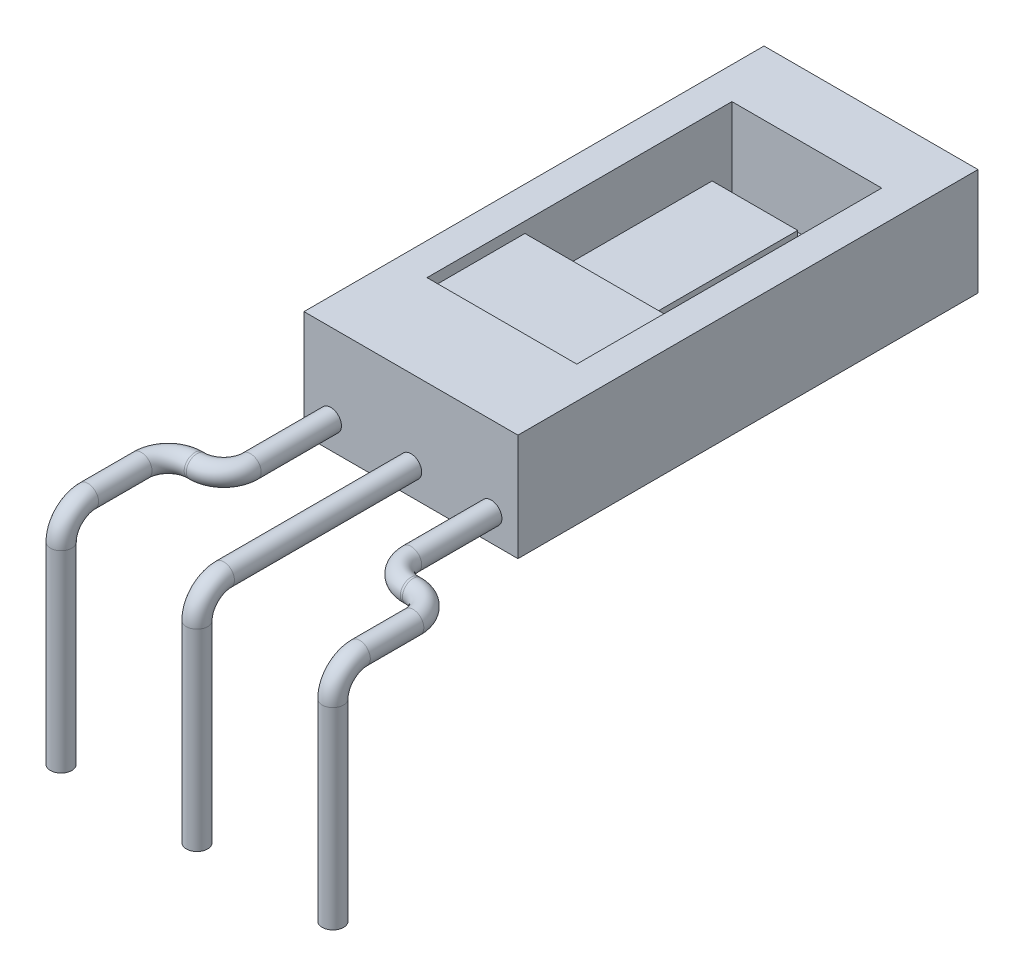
from build123d import *

# Parameters (mm, degrees)
ESQUISSE1_W             = 4
ESQUISSE1_H             = 8.6
EXTRUSION1_DEPTH        = 2
ESQUISSE3_W             = 2.8
ESQUISSE3_H             = 5.7
ENL_V_MAT_EXTRU_1_DEPTH = 1.5
ESQUISSE4_W             = 2.801496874
ESQUISSE4_H             = 1.83
EXTRUSION2_DEPTH        = 1.3
ESQUISSE5_W             = 1.6
ESQUISSE5_H             = 2.9
EXTRUSION3_DEPTH        = 1
ESQUISSE6_R             = 0.2
ESQUISSE8_R             = 0.2


with BuildPart() as part:
    # Esquisse1 → Extrusion1 (new body)
    with BuildSketch(Plane(origin=(0, 0, 0), x_dir=(1, 0, 0), z_dir=(0, 1, 0))):
        with Locations((0, 4.3)):
            Rectangle(ESQUISSE1_W, ESQUISSE1_H)
    extrude(amount=EXTRUSION1_DEPTH)

    # Esquisse3 → Enl_v. mat.-Extru.1 (cut)
    with BuildSketch(Plane(origin=(0, 2, 0), x_dir=(-1, 0, 0), z_dir=(0, 1, 0))):
        with Locations((0, -4.55)):
            Rectangle(ESQUISSE3_W, ESQUISSE3_H)
    extrude(amount=-ENL_V_MAT_EXTRU_1_DEPTH, mode=Mode.SUBTRACT)

    # Esquisse4 → Extrusion2 (add)
    with BuildSketch(Plane(origin=(0, 0.5, 0), x_dir=(-1, 0, 0), z_dir=(0, 1, 0))):
        with Locations((-0.000748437, -2.615)):
            Rectangle(ESQUISSE4_W, ESQUISSE4_H)
    extrude(amount=EXTRUSION2_DEPTH)

    # Esquisse5 → Extrusion3 (add)
    with BuildSketch(Plane(origin=(0, 0.5, 0), x_dir=(-1, 0, 0), z_dir=(0, 1, 0))):
        with Locations((0, -4.98)):
            Rectangle(ESQUISSE5_W, ESQUISSE5_H)
    extrude(amount=EXTRUSION3_DEPTH)

    # Balayage1: sweep along a path in Esquisse7
    with BuildLine(Plane(origin=(0, 0, 0), x_dir=(0, 0, -1), z_dir=(1, 0, 0))) as balayage1_path:
        Line((0, 0.5), (-3.5, 0.5))
        ThreePointArc((-3.5, 0.5), (-3.853553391, 0.353553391), (-4, 0))
        Line((-4, 0), (-4, -3.6))
    # Esquisse6 → Balayage1 (sweep)
    with BuildSketch(Plane.XY):
        with Locations((0, 0.5)):
            Circle(ESQUISSE6_R)
    sweep(path=balayage1_path.line)

    # Balayage2: sweep along a curve in space
    with BuildLine() as balayage2_path:
        Line((-1.5, 0.5, 0), (-1.5, 0.5, 1.5))
        ThreePointArc((-1.5, 0.5, 1.5), (-1.646446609, 0.5, 1.853553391), (-2, 0.5, 2))
        Line((-2, 0.5, 2), (-2.04, 0.5, 2))
        ThreePointArc((-2.04, 0.5, 2), (-2.393553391, 0.5, 2.146446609), (-2.54, 0.5, 2.5))
        Line((-2.54, 0.5, 2.5), (-2.54, 0.5, 3.5))
        ThreePointArc((-2.54, 0.5, 3.5), (-2.54, 0.353553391, 3.853553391), (-2.54, 0, 4))
        Line((-2.54, 0, 4), (-2.54, -3.6, 4))
    # Esquisse8 → Balayage2 (sweep)
    with BuildSketch(Plane.XY):
        with Locations((-1.5, 0.5)):
            Circle(ESQUISSE8_R)
    balayage2 = sweep(path=balayage2_path.line)

    # Sym_trie1: Balayage2 across plane
    add(balayage2.mirror(Plane(origin=(0, 0, 0), x_dir=(0, 0, 1), z_dir=(1, 0, 0))))


solid = part.part
